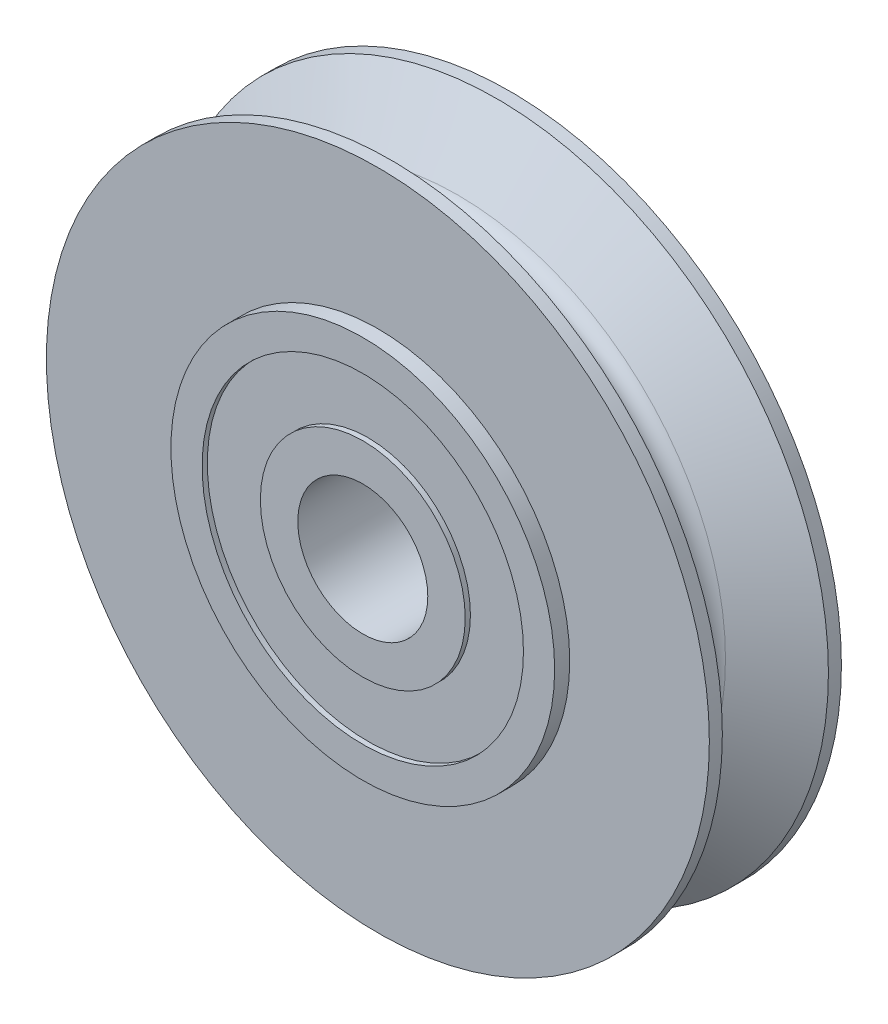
ISO-10303-21;
HEADER;
FILE_DESCRIPTION(('STEP AP214'),'2;1');
FILE_NAME('part.step','',(''),(''),'','','');
FILE_SCHEMA(('AUTOMOTIVE_DESIGN { 1 0 10303 214 1 1 1 1 }'));
ENDSEC;
DATA;
#1=APPLICATION_CONTEXT('core data for automotive mechanical design processes');
#2=APPLICATION_PROTOCOL_DEFINITION('international standard','automotive_design',2000,#1);
#3=PRODUCT_CONTEXT('',#1,'mechanical');
#4=PRODUCT('Part','Part','',(#3));
#5=PRODUCT_RELATED_PRODUCT_CATEGORY('part','',(#4));
#6=PRODUCT_DEFINITION_FORMATION('','',#4);
#7=PRODUCT_DEFINITION_CONTEXT('part definition',#1,'design');
#8=PRODUCT_DEFINITION('design','',#6,#7);
#9=PRODUCT_DEFINITION_SHAPE('','',#8);
#10=(LENGTH_UNIT() NAMED_UNIT(*) SI_UNIT(.MILLI.,.METRE.));
#11=(NAMED_UNIT(*) PLANE_ANGLE_UNIT() SI_UNIT($,.RADIAN.));
#12=(NAMED_UNIT(*) SI_UNIT($,.STERADIAN.) SOLID_ANGLE_UNIT());
#13=UNCERTAINTY_MEASURE_WITH_UNIT(LENGTH_MEASURE(1.E-05),#10,'distance_accuracy_value','');
#14=(GEOMETRIC_REPRESENTATION_CONTEXT(3) GLOBAL_UNCERTAINTY_ASSIGNED_CONTEXT((#13)) GLOBAL_UNIT_ASSIGNED_CONTEXT((#10,
#11,#12)) REPRESENTATION_CONTEXT('',''));
#15=CARTESIAN_POINT('',(0.,0.,0.));
#16=DIRECTION('',(0.,0.,1.));
#17=DIRECTION('',(1.,0.,0.));
#18=AXIS2_PLACEMENT_3D('',#15,#16,#17);
#19=CARTESIAN_POINT('',(0.735846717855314,2.26470332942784,0.));
#20=DIRECTION('',(0.309016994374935,0.951056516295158,0.));
#21=DIRECTION('',(0.,0.,-1.));
#22=AXIS2_PLACEMENT_3D('',#19,#20,#21);
#23=SPHERICAL_SURFACE('',#22,0.0555625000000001);
#24=CARTESIAN_POINT('',(0.753016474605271,2.31754640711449,0.));
#25=VERTEX_POINT('',#24);
#26=VERTEX_LOOP('',#25);
#27=FACE_BOUND('',#26,.T.);
#28=ADVANCED_FACE('F43',(#27),#23,.T.);
#29=CLOSED_SHELL('',(#28));
#30=MANIFOLD_SOLID_BREP('B2',#29);
#31=CARTESIAN_POINT('',(1.39966363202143,1.92647171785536,0.));
#32=DIRECTION('',(0.587785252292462,0.809016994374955,0.));
#33=DIRECTION('',(0.,0.,-1.));
#34=AXIS2_PLACEMENT_3D('',#31,#32,#33);
#35=SPHERICAL_SURFACE('',#34,0.0555625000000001);
#36=CARTESIAN_POINT('',(1.43232245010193,1.97142272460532,0.));
#37=VERTEX_POINT('',#36);
#38=VERTEX_LOOP('',#37);
#39=FACE_BOUND('',#38,.T.);
#40=ADVANCED_FACE('F61',(#39),#35,.T.);
#41=CLOSED_SHELL('',(#40));
#42=MANIFOLD_SOLID_BREP('B6',#41);
#43=CARTESIAN_POINT('',(1.92647171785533,1.39966363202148,0.));
#44=DIRECTION('',(0.80901699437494,0.587785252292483,0.));
#45=DIRECTION('',(0.,0.,-1.));
#46=AXIS2_PLACEMENT_3D('',#43,#44,#45);
#47=SPHERICAL_SURFACE('',#46,0.0555625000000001);
#48=CARTESIAN_POINT('',(1.97142272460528,1.43232245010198,0.));
#49=VERTEX_POINT('',#48);
#50=VERTEX_LOOP('',#49);
#51=FACE_BOUND('',#50,.T.);
#52=ADVANCED_FACE('F79',(#51),#47,.T.);
#53=CLOSED_SHELL('',(#52));
#54=MANIFOLD_SOLID_BREP('B39',#53);
#55=CARTESIAN_POINT('',(2.26470332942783,0.735846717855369,0.));
#56=DIRECTION('',(0.95105651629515,0.309016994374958,0.));
#57=DIRECTION('',(0.,0.,-1.));
#58=AXIS2_PLACEMENT_3D('',#55,#56,#57);
#59=SPHERICAL_SURFACE('',#58,0.0555625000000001);
#60=CARTESIAN_POINT('',(2.31754640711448,0.753016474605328,0.));
#61=VERTEX_POINT('',#60);
#62=VERTEX_LOOP('',#61);
#63=FACE_BOUND('',#62,.T.);
#64=ADVANCED_FACE('F97',(#63),#59,.T.);
#65=CLOSED_SHELL('',(#64));
#66=MANIFOLD_SOLID_BREP('B57',#65);
#67=CARTESIAN_POINT('',(2.38125,0.,0.));
#68=DIRECTION('',(1.,0.,0.));
#69=DIRECTION('',(0.,0.,-1.));
#70=AXIS2_PLACEMENT_3D('',#67,#68,#69);
#71=SPHERICAL_SURFACE('',#70,0.0555625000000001);
#72=CARTESIAN_POINT('',(2.4368125,0.,0.));
#73=VERTEX_POINT('',#72);
#74=VERTEX_LOOP('',#73);
#75=FACE_BOUND('',#74,.T.);
#76=ADVANCED_FACE('F115',(#75),#71,.T.);
#77=CLOSED_SHELL('',(#76));
#78=MANIFOLD_SOLID_BREP('B75',#77);
#79=CARTESIAN_POINT('',(2.26470332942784,-0.735846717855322,0.));
#80=DIRECTION('',(0.951056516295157,-0.309016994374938,0.));
#81=DIRECTION('',(0.,0.,-1.));
#82=AXIS2_PLACEMENT_3D('',#79,#80,#81);
#83=SPHERICAL_SURFACE('',#82,0.0555625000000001);
#84=CARTESIAN_POINT('',(2.31754640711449,-0.753016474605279,0.));
#85=VERTEX_POINT('',#84);
#86=VERTEX_LOOP('',#85);
#87=FACE_BOUND('',#86,.T.);
#88=ADVANCED_FACE('F133',(#87),#83,.T.);
#89=CLOSED_SHELL('',(#88));
#90=MANIFOLD_SOLID_BREP('B93',#89);
#91=CARTESIAN_POINT('',(1.92647171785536,-1.39966363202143,0.));
#92=DIRECTION('',(0.809016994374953,-0.587785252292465,0.));
#93=DIRECTION('',(0.,0.,-1.));
#94=AXIS2_PLACEMENT_3D('',#91,#92,#93);
#95=SPHERICAL_SURFACE('',#94,0.0555625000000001);
#96=CARTESIAN_POINT('',(1.97142272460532,-1.43232245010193,0.));
#97=VERTEX_POINT('',#96);
#98=VERTEX_LOOP('',#97);
#99=FACE_BOUND('',#98,.T.);
#100=ADVANCED_FACE('F151',(#99),#95,.T.);
#101=CLOSED_SHELL('',(#100));
#102=MANIFOLD_SOLID_BREP('B111',#101);
#103=CARTESIAN_POINT('',(1.39966363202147,-1.92647171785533,0.));
#104=DIRECTION('',(0.58778525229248,-0.809016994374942,0.));
#105=DIRECTION('',(0.,0.,-1.));
#106=AXIS2_PLACEMENT_3D('',#103,#104,#105);
#107=SPHERICAL_SURFACE('',#106,0.0555625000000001);
#108=CARTESIAN_POINT('',(1.43232245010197,-1.97142272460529,0.));
#109=VERTEX_POINT('',#108);
#110=VERTEX_LOOP('',#109);
#111=FACE_BOUND('',#110,.T.);
#112=ADVANCED_FACE('F169',(#111),#107,.T.);
#113=CLOSED_SHELL('',(#112));
#114=MANIFOLD_SOLID_BREP('B129',#113);
#115=CARTESIAN_POINT('',(0.735846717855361,-2.26470332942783,0.));
#116=DIRECTION('',(0.309016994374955,-0.951056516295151,0.));
#117=DIRECTION('',(0.,0.,-1.));
#118=AXIS2_PLACEMENT_3D('',#115,#116,#117);
#119=SPHERICAL_SURFACE('',#118,0.0555625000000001);
#120=CARTESIAN_POINT('',(0.75301647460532,-2.31754640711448,0.));
#121=VERTEX_POINT('',#120);
#122=VERTEX_LOOP('',#121);
#123=FACE_BOUND('',#122,.T.);
#124=ADVANCED_FACE('F187',(#123),#119,.T.);
#125=CLOSED_SHELL('',(#124));
#126=MANIFOLD_SOLID_BREP('B147',#125);
#127=CARTESIAN_POINT('',(0.,-2.38125,0.));
#128=DIRECTION('',(0.,-1.,0.));
#129=DIRECTION('',(0.,0.,-1.));
#130=AXIS2_PLACEMENT_3D('',#127,#128,#129);
#131=SPHERICAL_SURFACE('',#130,0.0555625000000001);
#132=CARTESIAN_POINT('',(0.,-2.4368125,0.));
#133=VERTEX_POINT('',#132);
#134=VERTEX_LOOP('',#133);
#135=FACE_BOUND('',#134,.T.);
#136=ADVANCED_FACE('F205',(#135),#131,.T.);
#137=CLOSED_SHELL('',(#136));
#138=MANIFOLD_SOLID_BREP('B165',#137);
#139=CARTESIAN_POINT('',(-0.735846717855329,-2.26470332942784,0.));
#140=DIRECTION('',(-0.309016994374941,-0.951056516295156,0.));
#141=DIRECTION('',(0.,0.,-1.));
#142=AXIS2_PLACEMENT_3D('',#139,#140,#141);
#143=SPHERICAL_SURFACE('',#142,0.0555625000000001);
#144=CARTESIAN_POINT('',(-0.753016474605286,-2.31754640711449,0.));
#145=VERTEX_POINT('',#144);
#146=VERTEX_LOOP('',#145);
#147=FACE_BOUND('',#146,.T.);
#148=ADVANCED_FACE('F223',(#147),#143,.T.);
#149=CLOSED_SHELL('',(#148));
#150=MANIFOLD_SOLID_BREP('B183',#149);
#151=CARTESIAN_POINT('',(-1.39966363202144,-1.92647171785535,0.));
#152=DIRECTION('',(-0.587785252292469,-0.809016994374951,0.));
#153=DIRECTION('',(0.,0.,-1.));
#154=AXIS2_PLACEMENT_3D('',#151,#152,#153);
#155=SPHERICAL_SURFACE('',#154,0.0555625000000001);
#156=CARTESIAN_POINT('',(-1.43232245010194,-1.97142272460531,0.));
#157=VERTEX_POINT('',#156);
#158=VERTEX_LOOP('',#157);
#159=FACE_BOUND('',#158,.T.);
#160=ADVANCED_FACE('F241',(#159),#155,.T.);
#161=CLOSED_SHELL('',(#160));
#162=MANIFOLD_SOLID_BREP('B201',#161);
#163=CARTESIAN_POINT('',(-1.92647171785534,-1.39966363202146,0.));
#164=DIRECTION('',(-0.809016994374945,-0.587785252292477,0.));
#165=DIRECTION('',(0.,0.,-1.));
#166=AXIS2_PLACEMENT_3D('',#163,#164,#165);
#167=SPHERICAL_SURFACE('',#166,0.0555625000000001);
#168=CARTESIAN_POINT('',(-1.97142272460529,-1.43232245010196,0.));
#169=VERTEX_POINT('',#168);
#170=VERTEX_LOOP('',#169);
#171=FACE_BOUND('',#170,.T.);
#172=ADVANCED_FACE('F259',(#171),#167,.T.);
#173=CLOSED_SHELL('',(#172));
#174=MANIFOLD_SOLID_BREP('B219',#173);
#175=CARTESIAN_POINT('',(-2.26470332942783,-0.735846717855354,0.));
#176=DIRECTION('',(-0.951056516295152,-0.309016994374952,0.));
#177=DIRECTION('',(0.,0.,-1.));
#178=AXIS2_PLACEMENT_3D('',#175,#176,#177);
#179=SPHERICAL_SURFACE('',#178,0.0555625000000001);
#180=CARTESIAN_POINT('',(-2.31754640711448,-0.753016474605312,0.));
#181=VERTEX_POINT('',#180);
#182=VERTEX_LOOP('',#181);
#183=FACE_BOUND('',#182,.T.);
#184=ADVANCED_FACE('F277',(#183),#179,.T.);
#185=CLOSED_SHELL('',(#184));
#186=MANIFOLD_SOLID_BREP('B237',#185);
#187=CARTESIAN_POINT('',(-2.38125,0.,0.));
#188=DIRECTION('',(-1.,0.,0.));
#189=DIRECTION('',(0.,0.,-1.));
#190=AXIS2_PLACEMENT_3D('',#187,#188,#189);
#191=SPHERICAL_SURFACE('',#190,0.0555625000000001);
#192=CARTESIAN_POINT('',(-2.4368125,0.,0.));
#193=VERTEX_POINT('',#192);
#194=VERTEX_LOOP('',#193);
#195=FACE_BOUND('',#194,.T.);
#196=ADVANCED_FACE('F295',(#195),#191,.T.);
#197=CLOSED_SHELL('',(#196));
#198=MANIFOLD_SOLID_BREP('B255',#197);
#199=CARTESIAN_POINT('',(-2.26470332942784,0.735846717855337,0.));
#200=DIRECTION('',(-0.951056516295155,0.309016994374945,0.));
#201=DIRECTION('',(0.,0.,-1.));
#202=AXIS2_PLACEMENT_3D('',#199,#200,#201);
#203=SPHERICAL_SURFACE('',#202,0.0555625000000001);
#204=CARTESIAN_POINT('',(-2.31754640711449,0.753016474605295,0.));
#205=VERTEX_POINT('',#204);
#206=VERTEX_LOOP('',#205);
#207=FACE_BOUND('',#206,.T.);
#208=ADVANCED_FACE('F313',(#207),#203,.T.);
#209=CLOSED_SHELL('',(#208));
#210=MANIFOLD_SOLID_BREP('B273',#209);
#211=CARTESIAN_POINT('',(-1.92647171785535,1.39966363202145,0.));
#212=DIRECTION('',(-0.809016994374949,0.587785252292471,0.));
#213=DIRECTION('',(0.,0.,-1.));
#214=AXIS2_PLACEMENT_3D('',#211,#212,#213);
#215=SPHERICAL_SURFACE('',#214,0.0555625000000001);
#216=CARTESIAN_POINT('',(-1.97142272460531,1.43232245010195,0.));
#217=VERTEX_POINT('',#216);
#218=VERTEX_LOOP('',#217);
#219=FACE_BOUND('',#218,.T.);
#220=ADVANCED_FACE('F331',(#219),#215,.T.);
#221=CLOSED_SHELL('',(#220));
#222=MANIFOLD_SOLID_BREP('B291',#221);
#223=CARTESIAN_POINT('',(-1.39966363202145,1.92647171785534,0.));
#224=DIRECTION('',(-0.587785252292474,0.809016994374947,0.));
#225=DIRECTION('',(0.,0.,-1.));
#226=AXIS2_PLACEMENT_3D('',#223,#224,#225);
#227=SPHERICAL_SURFACE('',#226,0.0555625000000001);
#228=CARTESIAN_POINT('',(-1.43232245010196,1.9714227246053,0.));
#229=VERTEX_POINT('',#228);
#230=VERTEX_LOOP('',#229);
#231=FACE_BOUND('',#230,.T.);
#232=ADVANCED_FACE('F349',(#231),#227,.T.);
#233=CLOSED_SHELL('',(#232));
#234=MANIFOLD_SOLID_BREP('B309',#233);
#235=CARTESIAN_POINT('',(-0.735846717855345,2.26470332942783,0.));
#236=DIRECTION('',(-0.309016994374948,0.951056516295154,0.));
#237=DIRECTION('',(0.,0.,-1.));
#238=AXIS2_PLACEMENT_3D('',#235,#236,#237);
#239=SPHERICAL_SURFACE('',#238,0.0555625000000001);
#240=CARTESIAN_POINT('',(-0.753016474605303,2.31754640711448,0.));
#241=VERTEX_POINT('',#240);
#242=VERTEX_LOOP('',#241);
#243=FACE_BOUND('',#242,.T.);
#244=ADVANCED_FACE('F367',(#243),#239,.T.);
#245=CLOSED_SHELL('',(#244));
#246=MANIFOLD_SOLID_BREP('B327',#245);
#247=CARTESIAN_POINT('',(0.,2.38125,0.));
#248=DIRECTION('',(0.,1.,0.));
#249=DIRECTION('',(0.,0.,-1.));
#250=AXIS2_PLACEMENT_3D('',#247,#248,#249);
#251=SPHERICAL_SURFACE('',#250,0.0555625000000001);
#252=CARTESIAN_POINT('',(0.,2.4368125,0.));
#253=VERTEX_POINT('',#252);
#254=VERTEX_LOOP('',#253);
#255=FACE_BOUND('',#254,.T.);
#256=ADVANCED_FACE('F387',(#255),#251,.T.);
#257=CLOSED_SHELL('',(#256));
#258=MANIFOLD_SOLID_BREP('B345',#257);
#259=CARTESIAN_POINT('',(0.,0.,0.));
#260=DIRECTION('',(0.,0.,1.));
#261=DIRECTION('',(1.,0.,0.));
#262=AXIS2_PLACEMENT_3D('',#259,#260,#261);
#263=TOROIDAL_SURFACE('',#262,6.746875,0.396875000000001);
#264=CARTESIAN_POINT('',(0.,0.,0.338097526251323));
#265=DIRECTION('',(0.,0.,1.));
#266=DIRECTION('',(1.,0.,0.));
#267=AXIS2_PLACEMENT_3D('',#264,#265,#266);
#268=CIRCLE('',#267,6.5390293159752);
#269=CARTESIAN_POINT('',(6.5390293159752,0.,0.338097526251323));
#270=VERTEX_POINT('',#269);
#271=EDGE_CURVE('E386',#270,#270,#268,.T.);
#272=ORIENTED_EDGE('',*,*,#271,.F.);
#273=EDGE_LOOP('',(#272));
#274=FACE_BOUND('',#273,.T.);
#275=CARTESIAN_POINT('',(0.,0.,-0.338097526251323));
#276=DIRECTION('',(0.,0.,1.));
#277=DIRECTION('',(1.,0.,0.));
#278=AXIS2_PLACEMENT_3D('',#275,#276,#277);
#279=CIRCLE('',#278,6.5390293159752);
#280=CARTESIAN_POINT('',(6.5390293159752,0.,-0.338097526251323));
#281=VERTEX_POINT('',#280);
#282=EDGE_CURVE('E469',#281,#281,#279,.T.);
#283=ORIENTED_EDGE('',*,*,#282,.T.);
#284=EDGE_LOOP('',(#283));
#285=FACE_BOUND('',#284,.T.);
#286=ADVANCED_FACE('F404',(#274,#285),#263,.F.);
#287=CARTESIAN_POINT('',(0.,0.,0.338097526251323));
#288=DIRECTION('',(0.,0.,1.));
#289=DIRECTION('',(1.,0.,0.));
#290=AXIS2_PLACEMENT_3D('',#287,#288,#289);
#291=CONICAL_SURFACE('',#290,6.5390293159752,1.01960128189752);
#292=CARTESIAN_POINT('',(0.,0.,1.2954));
#293=DIRECTION('',(0.,0.,1.));
#294=DIRECTION('',(1.,0.,0.));
#295=AXIS2_PLACEMENT_3D('',#292,#293,#294);
#296=CIRCLE('',#295,8.09625);
#297=CARTESIAN_POINT('',(8.09625,0.,1.2954));
#298=VERTEX_POINT('',#297);
#299=EDGE_CURVE('E411',#298,#298,#296,.T.);
#300=ORIENTED_EDGE('',*,*,#299,.F.);
#301=EDGE_LOOP('',(#300));
#302=FACE_BOUND('',#301,.T.);
#303=ORIENTED_EDGE('',*,*,#271,.T.);
#304=EDGE_LOOP('',(#303));
#305=FACE_BOUND('',#304,.T.);
#306=ADVANCED_FACE('F578',(#302,#305),#291,.T.);
#307=CARTESIAN_POINT('',(0.,0.,1.5875));
#308=DIRECTION('',(0.,0.,1.));
#309=DIRECTION('',(1.,0.,0.));
#310=AXIS2_PLACEMENT_3D('',#307,#308,#309);
#311=CYLINDRICAL_SURFACE('',#310,8.09625);
#312=CARTESIAN_POINT('',(0.,0.,1.6129));
#313=DIRECTION('',(0.,0.,1.));
#314=DIRECTION('',(1.,0.,0.));
#315=AXIS2_PLACEMENT_3D('',#312,#313,#314);
#316=CIRCLE('',#315,8.09625);
#317=CARTESIAN_POINT('',(8.09625,0.,1.6129));
#318=VERTEX_POINT('',#317);
#319=EDGE_CURVE('E415',#318,#318,#316,.T.);
#320=ORIENTED_EDGE('',*,*,#319,.F.);
#321=EDGE_LOOP('',(#320));
#322=FACE_BOUND('',#321,.T.);
#323=ORIENTED_EDGE('',*,*,#299,.T.);
#324=EDGE_LOOP('',(#323));
#325=FACE_BOUND('',#324,.T.);
#326=ADVANCED_FACE('F573',(#322,#325),#311,.T.);
#327=CARTESIAN_POINT('',(0.,4.6863,1.6129));
#328=DIRECTION('',(0.,0.,-1.));
#329=DIRECTION('',(-1.,0.,0.));
#330=AXIS2_PLACEMENT_3D('',#327,#328,#329);
#331=PLANE('',#330);
#332=CARTESIAN_POINT('',(0.,0.,1.6129));
#333=DIRECTION('',(0.,0.,1.));
#334=DIRECTION('',(1.,0.,0.));
#335=AXIS2_PLACEMENT_3D('',#332,#333,#334);
#336=CIRCLE('',#335,4.6863);
#337=CARTESIAN_POINT('',(4.6863,0.,1.6129));
#338=VERTEX_POINT('',#337);
#339=EDGE_CURVE('E419',#338,#338,#336,.T.);
#340=ORIENTED_EDGE('',*,*,#339,.F.);
#341=EDGE_LOOP('',(#340));
#342=FACE_BOUND('',#341,.T.);
#343=ORIENTED_EDGE('',*,*,#319,.T.);
#344=EDGE_LOOP('',(#343));
#345=FACE_BOUND('',#344,.T.);
#346=ADVANCED_FACE('F567',(#342,#345),#331,.F.);
#347=CARTESIAN_POINT('',(0.,0.,1.5875));
#348=DIRECTION('',(0.,0.,1.));
#349=DIRECTION('',(1.,0.,0.));
#350=AXIS2_PLACEMENT_3D('',#347,#348,#349);
#351=CYLINDRICAL_SURFACE('',#350,4.6863);
#352=CARTESIAN_POINT('',(0.,0.,1.9812));
#353=DIRECTION('',(0.,0.,1.));
#354=DIRECTION('',(1.,0.,0.));
#355=AXIS2_PLACEMENT_3D('',#352,#353,#354);
#356=CIRCLE('',#355,4.6863);
#357=CARTESIAN_POINT('',(4.6863,0.,1.9812));
#358=VERTEX_POINT('',#357);
#359=EDGE_CURVE('E424',#358,#358,#356,.T.);
#360=ORIENTED_EDGE('',*,*,#359,.F.);
#361=EDGE_LOOP('',(#360));
#362=FACE_BOUND('',#361,.T.);
#363=ORIENTED_EDGE('',*,*,#339,.T.);
#364=EDGE_LOOP('',(#363));
#365=FACE_BOUND('',#364,.T.);
#366=ADVANCED_FACE('F561',(#362,#365),#351,.T.);
#367=CARTESIAN_POINT('',(0.,4.6863,1.9812));
#368=DIRECTION('',(0.,0.,-1.));
#369=DIRECTION('',(-1.,0.,0.));
#370=AXIS2_PLACEMENT_3D('',#367,#368,#369);
#371=PLANE('',#370);
#372=CARTESIAN_POINT('',(0.,0.,1.9812));
#373=DIRECTION('',(0.,0.,1.));
#374=DIRECTION('',(1.,0.,0.));
#375=AXIS2_PLACEMENT_3D('',#372,#373,#374);
#376=CIRCLE('',#375,3.9243);
#377=CARTESIAN_POINT('',(3.9243,0.,1.9812));
#378=VERTEX_POINT('',#377);
#379=EDGE_CURVE('E427',#378,#378,#376,.T.);
#380=ORIENTED_EDGE('',*,*,#379,.F.);
#381=EDGE_LOOP('',(#380));
#382=FACE_BOUND('',#381,.T.);
#383=ORIENTED_EDGE('',*,*,#359,.T.);
#384=EDGE_LOOP('',(#383));
#385=FACE_BOUND('',#384,.T.);
#386=ADVANCED_FACE('F555',(#382,#385),#371,.F.);
#387=CARTESIAN_POINT('',(0.,0.,1.5875));
#388=DIRECTION('',(0.,0.,1.));
#389=DIRECTION('',(1.,0.,0.));
#390=AXIS2_PLACEMENT_3D('',#387,#388,#389);
#391=CYLINDRICAL_SURFACE('',#390,3.9243);
#392=CARTESIAN_POINT('',(0.,0.,1.8542));
#393=DIRECTION('',(0.,0.,1.));
#394=DIRECTION('',(1.,0.,0.));
#395=AXIS2_PLACEMENT_3D('',#392,#393,#394);
#396=CIRCLE('',#395,3.9243);
#397=CARTESIAN_POINT('',(3.9243,0.,1.8542));
#398=VERTEX_POINT('',#397);
#399=EDGE_CURVE('E430',#398,#398,#396,.T.);
#400=ORIENTED_EDGE('',*,*,#399,.F.);
#401=EDGE_LOOP('',(#400));
#402=FACE_BOUND('',#401,.T.);
#403=ORIENTED_EDGE('',*,*,#379,.T.);
#404=EDGE_LOOP('',(#403));
#405=FACE_BOUND('',#404,.T.);
#406=ADVANCED_FACE('F549',(#402,#405),#391,.F.);
#407=CARTESIAN_POINT('',(0.,3.9243,1.8542));
#408=DIRECTION('',(0.,0.,-1.));
#409=DIRECTION('',(-1.,0.,0.));
#410=AXIS2_PLACEMENT_3D('',#407,#408,#409);
#411=PLANE('',#410);
#412=CARTESIAN_POINT('',(0.,0.,1.8542));
#413=DIRECTION('',(0.,0.,1.));
#414=DIRECTION('',(1.,0.,0.));
#415=AXIS2_PLACEMENT_3D('',#412,#413,#414);
#416=CIRCLE('',#415,2.5019);
#417=CARTESIAN_POINT('',(2.5019,0.,1.8542));
#418=VERTEX_POINT('',#417);
#419=EDGE_CURVE('E433',#418,#418,#416,.T.);
#420=ORIENTED_EDGE('',*,*,#419,.F.);
#421=EDGE_LOOP('',(#420));
#422=FACE_BOUND('',#421,.T.);
#423=ORIENTED_EDGE('',*,*,#399,.T.);
#424=EDGE_LOOP('',(#423));
#425=FACE_BOUND('',#424,.T.);
#426=ADVANCED_FACE('F543',(#422,#425),#411,.F.);
#427=CARTESIAN_POINT('',(0.,0.,1.5875));
#428=DIRECTION('',(0.,0.,1.));
#429=DIRECTION('',(1.,0.,0.));
#430=AXIS2_PLACEMENT_3D('',#427,#428,#429);
#431=CYLINDRICAL_SURFACE('',#430,2.5019);
#432=CARTESIAN_POINT('',(0.,0.,1.9812));
#433=DIRECTION('',(0.,0.,1.));
#434=DIRECTION('',(1.,0.,0.));
#435=AXIS2_PLACEMENT_3D('',#432,#433,#434);
#436=CIRCLE('',#435,2.5019);
#437=CARTESIAN_POINT('',(2.5019,0.,1.9812));
#438=VERTEX_POINT('',#437);
#439=EDGE_CURVE('E436',#438,#438,#436,.T.);
#440=ORIENTED_EDGE('',*,*,#439,.F.);
#441=EDGE_LOOP('',(#440));
#442=FACE_BOUND('',#441,.T.);
#443=ORIENTED_EDGE('',*,*,#419,.T.);
#444=EDGE_LOOP('',(#443));
#445=FACE_BOUND('',#444,.T.);
#446=ADVANCED_FACE('F537',(#442,#445),#431,.T.);
#447=CARTESIAN_POINT('',(0.,2.5019,1.9812));
#448=DIRECTION('',(0.,0.,-1.));
#449=DIRECTION('',(-1.,0.,0.));
#450=AXIS2_PLACEMENT_3D('',#447,#448,#449);
#451=PLANE('',#450);
#452=CARTESIAN_POINT('',(0.,0.,1.9812));
#453=DIRECTION('',(0.,0.,1.));
#454=DIRECTION('',(1.,0.,0.));
#455=AXIS2_PLACEMENT_3D('',#452,#453,#454);
#456=CIRCLE('',#455,1.5875);
#457=CARTESIAN_POINT('',(1.5875,0.,1.9812));
#458=VERTEX_POINT('',#457);
#459=EDGE_CURVE('E439',#458,#458,#456,.T.);
#460=ORIENTED_EDGE('',*,*,#459,.F.);
#461=EDGE_LOOP('',(#460));
#462=FACE_BOUND('',#461,.T.);
#463=ORIENTED_EDGE('',*,*,#439,.T.);
#464=EDGE_LOOP('',(#463));
#465=FACE_BOUND('',#464,.T.);
#466=ADVANCED_FACE('F531',(#462,#465),#451,.F.);
#467=CARTESIAN_POINT('',(0.,0.,1.5875));
#468=DIRECTION('',(0.,0.,1.));
#469=DIRECTION('',(1.,0.,0.));
#470=AXIS2_PLACEMENT_3D('',#467,#468,#469);
#471=CYLINDRICAL_SURFACE('',#470,1.5875);
#472=CARTESIAN_POINT('',(0.,0.,-1.9812));
#473=DIRECTION('',(0.,0.,1.));
#474=DIRECTION('',(1.,0.,0.));
#475=AXIS2_PLACEMENT_3D('',#472,#473,#474);
#476=CIRCLE('',#475,1.5875);
#477=CARTESIAN_POINT('',(1.5875,0.,-1.9812));
#478=VERTEX_POINT('',#477);
#479=EDGE_CURVE('E442',#478,#478,#476,.T.);
#480=ORIENTED_EDGE('',*,*,#479,.F.);
#481=EDGE_LOOP('',(#480));
#482=FACE_BOUND('',#481,.T.);
#483=ORIENTED_EDGE('',*,*,#459,.T.);
#484=EDGE_LOOP('',(#483));
#485=FACE_BOUND('',#484,.T.);
#486=ADVANCED_FACE('F525',(#482,#485),#471,.F.);
#487=CARTESIAN_POINT('',(0.,2.5019,-1.9812));
#488=DIRECTION('',(0.,0.,1.));
#489=DIRECTION('',(1.,0.,0.));
#490=AXIS2_PLACEMENT_3D('',#487,#488,#489);
#491=PLANE('',#490);
#492=CARTESIAN_POINT('',(0.,0.,-1.9812));
#493=DIRECTION('',(0.,0.,1.));
#494=DIRECTION('',(1.,0.,0.));
#495=AXIS2_PLACEMENT_3D('',#492,#493,#494);
#496=CIRCLE('',#495,2.5019);
#497=CARTESIAN_POINT('',(2.5019,0.,-1.9812));
#498=VERTEX_POINT('',#497);
#499=EDGE_CURVE('E445',#498,#498,#496,.T.);
#500=ORIENTED_EDGE('',*,*,#499,.F.);
#501=EDGE_LOOP('',(#500));
#502=FACE_BOUND('',#501,.T.);
#503=ORIENTED_EDGE('',*,*,#479,.T.);
#504=EDGE_LOOP('',(#503));
#505=FACE_BOUND('',#504,.T.);
#506=ADVANCED_FACE('F519',(#502,#505),#491,.F.);
#507=CARTESIAN_POINT('',(0.,0.,1.5875));
#508=DIRECTION('',(0.,0.,1.));
#509=DIRECTION('',(1.,0.,0.));
#510=AXIS2_PLACEMENT_3D('',#507,#508,#509);
#511=CYLINDRICAL_SURFACE('',#510,2.5019);
#512=CARTESIAN_POINT('',(0.,0.,-1.8542));
#513=DIRECTION('',(0.,0.,1.));
#514=DIRECTION('',(1.,0.,0.));
#515=AXIS2_PLACEMENT_3D('',#512,#513,#514);
#516=CIRCLE('',#515,2.5019);
#517=CARTESIAN_POINT('',(2.5019,0.,-1.8542));
#518=VERTEX_POINT('',#517);
#519=EDGE_CURVE('E448',#518,#518,#516,.T.);
#520=ORIENTED_EDGE('',*,*,#519,.F.);
#521=EDGE_LOOP('',(#520));
#522=FACE_BOUND('',#521,.T.);
#523=ORIENTED_EDGE('',*,*,#499,.T.);
#524=EDGE_LOOP('',(#523));
#525=FACE_BOUND('',#524,.T.);
#526=ADVANCED_FACE('F513',(#522,#525),#511,.T.);
#527=CARTESIAN_POINT('',(0.,3.9243,-1.8542));
#528=DIRECTION('',(0.,0.,1.));
#529=DIRECTION('',(1.,0.,0.));
#530=AXIS2_PLACEMENT_3D('',#527,#528,#529);
#531=PLANE('',#530);
#532=CARTESIAN_POINT('',(0.,0.,-1.8542));
#533=DIRECTION('',(0.,0.,1.));
#534=DIRECTION('',(1.,0.,0.));
#535=AXIS2_PLACEMENT_3D('',#532,#533,#534);
#536=CIRCLE('',#535,3.9243);
#537=CARTESIAN_POINT('',(3.9243,0.,-1.8542));
#538=VERTEX_POINT('',#537);
#539=EDGE_CURVE('E451',#538,#538,#536,.T.);
#540=ORIENTED_EDGE('',*,*,#539,.F.);
#541=EDGE_LOOP('',(#540));
#542=FACE_BOUND('',#541,.T.);
#543=ORIENTED_EDGE('',*,*,#519,.T.);
#544=EDGE_LOOP('',(#543));
#545=FACE_BOUND('',#544,.T.);
#546=ADVANCED_FACE('F507',(#542,#545),#531,.F.);
#547=CARTESIAN_POINT('',(0.,0.,1.5875));
#548=DIRECTION('',(0.,0.,1.));
#549=DIRECTION('',(1.,0.,0.));
#550=AXIS2_PLACEMENT_3D('',#547,#548,#549);
#551=CYLINDRICAL_SURFACE('',#550,3.9243);
#552=CARTESIAN_POINT('',(0.,0.,-1.9812));
#553=DIRECTION('',(0.,0.,1.));
#554=DIRECTION('',(1.,0.,0.));
#555=AXIS2_PLACEMENT_3D('',#552,#553,#554);
#556=CIRCLE('',#555,3.9243);
#557=CARTESIAN_POINT('',(3.9243,0.,-1.9812));
#558=VERTEX_POINT('',#557);
#559=EDGE_CURVE('E454',#558,#558,#556,.T.);
#560=ORIENTED_EDGE('',*,*,#559,.F.);
#561=EDGE_LOOP('',(#560));
#562=FACE_BOUND('',#561,.T.);
#563=ORIENTED_EDGE('',*,*,#539,.T.);
#564=EDGE_LOOP('',(#563));
#565=FACE_BOUND('',#564,.T.);
#566=ADVANCED_FACE('F501',(#562,#565),#551,.F.);
#567=CARTESIAN_POINT('',(0.,4.6863,-1.9812));
#568=DIRECTION('',(0.,0.,1.));
#569=DIRECTION('',(1.,0.,0.));
#570=AXIS2_PLACEMENT_3D('',#567,#568,#569);
#571=PLANE('',#570);
#572=CARTESIAN_POINT('',(0.,0.,-1.9812));
#573=DIRECTION('',(0.,0.,1.));
#574=DIRECTION('',(1.,0.,0.));
#575=AXIS2_PLACEMENT_3D('',#572,#573,#574);
#576=CIRCLE('',#575,4.6863);
#577=CARTESIAN_POINT('',(4.6863,0.,-1.9812));
#578=VERTEX_POINT('',#577);
#579=EDGE_CURVE('E457',#578,#578,#576,.T.);
#580=ORIENTED_EDGE('',*,*,#579,.F.);
#581=EDGE_LOOP('',(#580));
#582=FACE_BOUND('',#581,.T.);
#583=ORIENTED_EDGE('',*,*,#559,.T.);
#584=EDGE_LOOP('',(#583));
#585=FACE_BOUND('',#584,.T.);
#586=ADVANCED_FACE('F495',(#582,#585),#571,.F.);
#587=CARTESIAN_POINT('',(0.,0.,1.5875));
#588=DIRECTION('',(0.,0.,1.));
#589=DIRECTION('',(1.,0.,0.));
#590=AXIS2_PLACEMENT_3D('',#587,#588,#589);
#591=CYLINDRICAL_SURFACE('',#590,4.6863);
#592=CARTESIAN_POINT('',(0.,0.,-1.6129));
#593=DIRECTION('',(0.,0.,1.));
#594=DIRECTION('',(1.,0.,0.));
#595=AXIS2_PLACEMENT_3D('',#592,#593,#594);
#596=CIRCLE('',#595,4.6863);
#597=CARTESIAN_POINT('',(4.6863,0.,-1.6129));
#598=VERTEX_POINT('',#597);
#599=EDGE_CURVE('E460',#598,#598,#596,.T.);
#600=ORIENTED_EDGE('',*,*,#599,.F.);
#601=EDGE_LOOP('',(#600));
#602=FACE_BOUND('',#601,.T.);
#603=ORIENTED_EDGE('',*,*,#579,.T.);
#604=EDGE_LOOP('',(#603));
#605=FACE_BOUND('',#604,.T.);
#606=ADVANCED_FACE('F489',(#602,#605),#591,.T.);
#607=CARTESIAN_POINT('',(0.,8.09625,-1.6129));
#608=DIRECTION('',(0.,0.,1.));
#609=DIRECTION('',(1.,0.,0.));
#610=AXIS2_PLACEMENT_3D('',#607,#608,#609);
#611=PLANE('',#610);
#612=CARTESIAN_POINT('',(0.,0.,-1.6129));
#613=DIRECTION('',(0.,0.,1.));
#614=DIRECTION('',(1.,0.,0.));
#615=AXIS2_PLACEMENT_3D('',#612,#613,#614);
#616=CIRCLE('',#615,8.09625);
#617=CARTESIAN_POINT('',(8.09625,0.,-1.6129));
#618=VERTEX_POINT('',#617);
#619=EDGE_CURVE('E463',#618,#618,#616,.T.);
#620=ORIENTED_EDGE('',*,*,#619,.F.);
#621=EDGE_LOOP('',(#620));
#622=FACE_BOUND('',#621,.T.);
#623=ORIENTED_EDGE('',*,*,#599,.T.);
#624=EDGE_LOOP('',(#623));
#625=FACE_BOUND('',#624,.T.);
#626=ADVANCED_FACE('F483',(#622,#625),#611,.F.);
#627=CARTESIAN_POINT('',(0.,0.,1.5875));
#628=DIRECTION('',(0.,0.,1.));
#629=DIRECTION('',(1.,0.,0.));
#630=AXIS2_PLACEMENT_3D('',#627,#628,#629);
#631=CYLINDRICAL_SURFACE('',#630,8.09625);
#632=CARTESIAN_POINT('',(0.,0.,-1.2954));
#633=DIRECTION('',(0.,0.,1.));
#634=DIRECTION('',(1.,0.,0.));
#635=AXIS2_PLACEMENT_3D('',#632,#633,#634);
#636=CIRCLE('',#635,8.09625);
#637=CARTESIAN_POINT('',(8.09625,0.,-1.2954));
#638=VERTEX_POINT('',#637);
#639=EDGE_CURVE('E466',#638,#638,#636,.T.);
#640=ORIENTED_EDGE('',*,*,#639,.F.);
#641=EDGE_LOOP('',(#640));
#642=FACE_BOUND('',#641,.T.);
#643=ORIENTED_EDGE('',*,*,#619,.T.);
#644=EDGE_LOOP('',(#643));
#645=FACE_BOUND('',#644,.T.);
#646=ADVANCED_FACE('F477',(#642,#645),#631,.T.);
#647=CARTESIAN_POINT('',(0.,0.,-1.2954));
#648=DIRECTION('',(0.,0.,-1.));
#649=DIRECTION('',(-1.,0.,0.));
#650=AXIS2_PLACEMENT_3D('',#647,#648,#649);
#651=CONICAL_SURFACE('',#650,8.09625,1.01960128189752);
#652=ORIENTED_EDGE('',*,*,#282,.F.);
#653=EDGE_LOOP('',(#652));
#654=FACE_BOUND('',#653,.T.);
#655=ORIENTED_EDGE('',*,*,#639,.T.);
#656=EDGE_LOOP('',(#655));
#657=FACE_BOUND('',#656,.T.);
#658=ADVANCED_FACE('F474',(#654,#657),#651,.T.);
#659=CLOSED_SHELL('',(#286,#306,#326,#346,#366,#386,#406,#426,#446,#466,#486,#506,#526,#546,
#566,#586,#606,#626,#646,#658));
#660=CARTESIAN_POINT('',(0.,0.,0.));
#661=DIRECTION('',(0.,0.,1.));
#662=DIRECTION('',(1.,0.,0.));
#663=AXIS2_PLACEMENT_3D('',#660,#661,#662);
#664=TOROIDAL_SURFACE('',#663,2.38125,0.0555625);
#665=CARTESIAN_POINT('',(2.4368125,0.,0.));
#666=VERTEX_POINT('',#665);
#667=VERTEX_LOOP('',#666);
#668=FACE_BOUND('',#667,.T.);
#669=ADVANCED_FACE('F718',(#668),#664,.F.);
#670=CLOSED_SHELL('',(#669));
#671=ORIENTED_CLOSED_SHELL('',*,#670,.T.);
#672=BREP_WITH_VOIDS('B363',#659,(#671));
#673=ADVANCED_BREP_SHAPE_REPRESENTATION('',(#18,#30,#42,#54,#66,#78,#90,#102,#114,#126,#138,
#150,#162,#174,#186,#198,#210,#222,#234,#246,#258,#672),#14);
#674=SHAPE_DEFINITION_REPRESENTATION(#9,#673);
ENDSEC;
END-ISO-10303-21;
